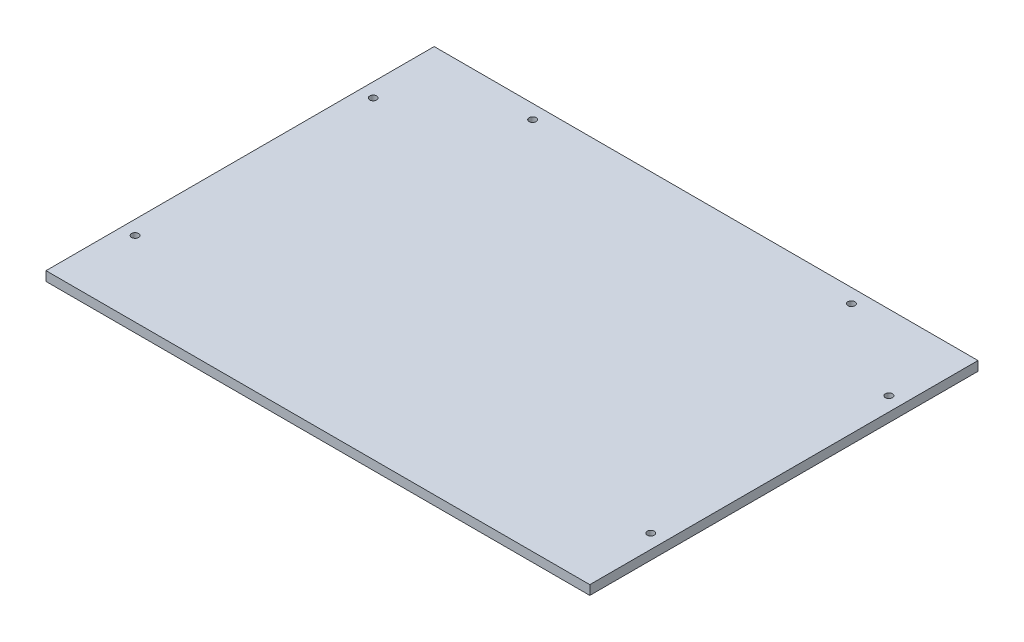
ISO-10303-21;
HEADER;
FILE_DESCRIPTION(('STEP AP214'),'2;1');
FILE_NAME('part.step','',(''),(''),'','','');
FILE_SCHEMA(('AUTOMOTIVE_DESIGN { 1 0 10303 214 1 1 1 1 }'));
ENDSEC;
DATA;
#1=APPLICATION_CONTEXT('core data for automotive mechanical design processes');
#2=APPLICATION_PROTOCOL_DEFINITION('international standard','automotive_design',2000,#1);
#3=PRODUCT_CONTEXT('',#1,'mechanical');
#4=PRODUCT('Part','Part','',(#3));
#5=PRODUCT_RELATED_PRODUCT_CATEGORY('part','',(#4));
#6=PRODUCT_DEFINITION_FORMATION('','',#4);
#7=PRODUCT_DEFINITION_CONTEXT('part definition',#1,'design');
#8=PRODUCT_DEFINITION('design','',#6,#7);
#9=PRODUCT_DEFINITION_SHAPE('','',#8);
#10=(LENGTH_UNIT() NAMED_UNIT(*) SI_UNIT(.MILLI.,.METRE.));
#11=(NAMED_UNIT(*) PLANE_ANGLE_UNIT() SI_UNIT($,.RADIAN.));
#12=(NAMED_UNIT(*) SI_UNIT($,.STERADIAN.) SOLID_ANGLE_UNIT());
#13=UNCERTAINTY_MEASURE_WITH_UNIT(LENGTH_MEASURE(1.E-05),#10,'distance_accuracy_value','');
#14=(GEOMETRIC_REPRESENTATION_CONTEXT(3) GLOBAL_UNCERTAINTY_ASSIGNED_CONTEXT((#13)) GLOBAL_UNIT_ASSIGNED_CONTEXT((#10,
#11,#12)) REPRESENTATION_CONTEXT('',''));
#15=CARTESIAN_POINT('',(0.,0.,0.));
#16=DIRECTION('',(0.,0.,1.));
#17=DIRECTION('',(1.,0.,0.));
#18=AXIS2_PLACEMENT_3D('',#15,#16,#17);
#19=CARTESIAN_POINT('',(0.,12.7,0.));
#20=DIRECTION('',(1.,0.,0.));
#21=DIRECTION('',(0.,0.,-1.));
#22=AXIS2_PLACEMENT_3D('',#19,#20,#21);
#23=PLANE('',#22);
#24=DIRECTION('',(0.,0.,1.));
#25=VECTOR('',#24,1.);
#26=CARTESIAN_POINT('',(0.,0.,0.));
#27=LINE('',#26,#25);
#28=CARTESIAN_POINT('',(0.,0.,-525.78));
#29=VERTEX_POINT('',#28);
#30=CARTESIAN_POINT('',(0.,0.,0.));
#31=VERTEX_POINT('',#30);
#32=EDGE_CURVE('E93',#29,#31,#27,.T.);
#33=ORIENTED_EDGE('',*,*,#32,.T.);
#34=DIRECTION('',(0.,-1.,0.));
#35=VECTOR('',#34,1.);
#36=CARTESIAN_POINT('',(0.,12.7,0.));
#37=LINE('',#36,#35);
#38=CARTESIAN_POINT('',(0.,12.7,0.));
#39=VERTEX_POINT('',#38);
#40=EDGE_CURVE('E11',#39,#31,#37,.T.);
#41=ORIENTED_EDGE('',*,*,#40,.F.);
#42=DIRECTION('',(0.,0.,1.));
#43=VECTOR('',#42,1.);
#44=CARTESIAN_POINT('',(0.,12.7,0.));
#45=LINE('',#44,#43);
#46=CARTESIAN_POINT('',(0.,12.7,-525.78));
#47=VERTEX_POINT('',#46);
#48=EDGE_CURVE('E81',#47,#39,#45,.T.);
#49=ORIENTED_EDGE('',*,*,#48,.F.);
#50=DIRECTION('',(0.,-1.,0.));
#51=VECTOR('',#50,1.);
#52=CARTESIAN_POINT('',(0.,12.7,-525.78));
#53=LINE('',#52,#51);
#54=EDGE_CURVE('E89',#47,#29,#53,.T.);
#55=ORIENTED_EDGE('',*,*,#54,.T.);
#56=EDGE_LOOP('',(#33,#41,#49,#55));
#57=FACE_BOUND('',#56,.T.);
#58=ADVANCED_FACE('F30',(#57),#23,.F.);
#59=CARTESIAN_POINT('',(0.,12.7,0.));
#60=DIRECTION('',(0.,0.,-1.));
#61=DIRECTION('',(-1.,0.,0.));
#62=AXIS2_PLACEMENT_3D('',#59,#60,#61);
#63=PLANE('',#62);
#64=DIRECTION('',(1.,0.,0.));
#65=VECTOR('',#64,1.);
#66=CARTESIAN_POINT('',(0.,0.,0.));
#67=LINE('',#66,#65);
#68=CARTESIAN_POINT('',(736.6,0.,0.));
#69=VERTEX_POINT('',#68);
#70=EDGE_CURVE('E85',#31,#69,#67,.T.);
#71=ORIENTED_EDGE('',*,*,#70,.T.);
#72=DIRECTION('',(0.,-1.,0.));
#73=VECTOR('',#72,1.);
#74=CARTESIAN_POINT('',(736.6,12.7,0.));
#75=LINE('',#74,#73);
#76=CARTESIAN_POINT('',(736.6,12.7,0.));
#77=VERTEX_POINT('',#76);
#78=EDGE_CURVE('E38',#77,#69,#75,.T.);
#79=ORIENTED_EDGE('',*,*,#78,.F.);
#80=DIRECTION('',(1.,0.,0.));
#81=VECTOR('',#80,1.);
#82=CARTESIAN_POINT('',(0.,12.7,0.));
#83=LINE('',#82,#81);
#84=EDGE_CURVE('E76',#39,#77,#83,.T.);
#85=ORIENTED_EDGE('',*,*,#84,.F.);
#86=ORIENTED_EDGE('',*,*,#40,.T.);
#87=EDGE_LOOP('',(#71,#79,#85,#86));
#88=FACE_BOUND('',#87,.T.);
#89=ADVANCED_FACE('F84',(#88),#63,.F.);
#90=CARTESIAN_POINT('',(736.6,12.7,0.));
#91=DIRECTION('',(-1.,0.,0.));
#92=DIRECTION('',(0.,0.,1.));
#93=AXIS2_PLACEMENT_3D('',#90,#91,#92);
#94=PLANE('',#93);
#95=DIRECTION('',(0.,0.,-1.));
#96=VECTOR('',#95,1.);
#97=CARTESIAN_POINT('',(736.6,0.,0.));
#98=LINE('',#97,#96);
#99=CARTESIAN_POINT('',(736.6,0.,-525.78));
#100=VERTEX_POINT('',#99);
#101=EDGE_CURVE('E63',#69,#100,#98,.T.);
#102=ORIENTED_EDGE('',*,*,#101,.T.);
#103=DIRECTION('',(0.,-1.,0.));
#104=VECTOR('',#103,1.);
#105=CARTESIAN_POINT('',(736.6,12.7,-525.78));
#106=LINE('',#105,#104);
#107=CARTESIAN_POINT('',(736.6,12.7,-525.78));
#108=VERTEX_POINT('',#107);
#109=EDGE_CURVE('E86',#108,#100,#106,.T.);
#110=ORIENTED_EDGE('',*,*,#109,.F.);
#111=DIRECTION('',(0.,0.,-1.));
#112=VECTOR('',#111,1.);
#113=CARTESIAN_POINT('',(736.6,12.7,0.));
#114=LINE('',#113,#112);
#115=EDGE_CURVE('E79',#77,#108,#114,.T.);
#116=ORIENTED_EDGE('',*,*,#115,.F.);
#117=ORIENTED_EDGE('',*,*,#78,.T.);
#118=EDGE_LOOP('',(#102,#110,#116,#117));
#119=FACE_BOUND('',#118,.T.);
#120=ADVANCED_FACE('F87',(#119),#94,.F.);
#121=CARTESIAN_POINT('',(0.,12.7,-525.78));
#122=DIRECTION('',(0.,0.,1.));
#123=DIRECTION('',(1.,0.,0.));
#124=AXIS2_PLACEMENT_3D('',#121,#122,#123);
#125=PLANE('',#124);
#126=DIRECTION('',(-1.,0.,0.));
#127=VECTOR('',#126,1.);
#128=CARTESIAN_POINT('',(0.,0.,-525.78));
#129=LINE('',#128,#127);
#130=EDGE_CURVE('E69',#100,#29,#129,.T.);
#131=ORIENTED_EDGE('',*,*,#130,.T.);
#132=ORIENTED_EDGE('',*,*,#54,.F.);
#133=DIRECTION('',(-1.,0.,0.));
#134=VECTOR('',#133,1.);
#135=CARTESIAN_POINT('',(0.,12.7,-525.78));
#136=LINE('',#135,#134);
#137=EDGE_CURVE('E46',#108,#47,#136,.T.);
#138=ORIENTED_EDGE('',*,*,#137,.F.);
#139=ORIENTED_EDGE('',*,*,#109,.T.);
#140=EDGE_LOOP('',(#131,#132,#138,#139));
#141=FACE_BOUND('',#140,.T.);
#142=ADVANCED_FACE('F101',(#141),#125,.F.);
#143=CARTESIAN_POINT('',(0.,12.7,-525.78));
#144=DIRECTION('',(0.,-1.,0.));
#145=DIRECTION('',(0.,0.,-1.));
#146=AXIS2_PLACEMENT_3D('',#143,#144,#145);
#147=PLANE('',#146);
#148=CARTESIAN_POINT('',(584.2,12.7,-506.73));
#149=DIRECTION('',(0.,1.,0.));
#150=DIRECTION('',(0.,0.,1.));
#151=AXIS2_PLACEMENT_3D('',#148,#149,#150);
#152=CIRCLE('',#151,4.76250000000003);
#153=CARTESIAN_POINT('',(584.2,12.7,-501.9675));
#154=VERTEX_POINT('',#153);
#155=EDGE_CURVE('E137',#154,#154,#152,.T.);
#156=ORIENTED_EDGE('',*,*,#155,.F.);
#157=EDGE_LOOP('',(#156));
#158=FACE_BOUND('',#157,.T.);
#159=CARTESIAN_POINT('',(152.4,12.7,-506.73));
#160=DIRECTION('',(0.,1.,0.));
#161=DIRECTION('',(0.,0.,1.));
#162=AXIS2_PLACEMENT_3D('',#159,#160,#161);
#163=CIRCLE('',#162,4.76250000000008);
#164=CARTESIAN_POINT('',(152.4,12.7,-501.9675));
#165=VERTEX_POINT('',#164);
#166=EDGE_CURVE('E131',#165,#165,#163,.T.);
#167=ORIENTED_EDGE('',*,*,#166,.F.);
#168=EDGE_LOOP('',(#167));
#169=FACE_BOUND('',#168,.T.);
#170=CARTESIAN_POINT('',(717.55,12.7,-424.18));
#171=DIRECTION('',(0.,1.,0.));
#172=DIRECTION('',(0.,0.,-1.));
#173=AXIS2_PLACEMENT_3D('',#170,#171,#172);
#174=CIRCLE('',#173,4.76250000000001);
#175=CARTESIAN_POINT('',(717.55,12.7,-419.4175));
#176=VERTEX_POINT('',#175);
#177=EDGE_CURVE('E125',#176,#176,#174,.T.);
#178=ORIENTED_EDGE('',*,*,#177,.F.);
#179=EDGE_LOOP('',(#178));
#180=FACE_BOUND('',#179,.T.);
#181=CARTESIAN_POINT('',(717.55,12.7,-101.6));
#182=DIRECTION('',(0.,1.,0.));
#183=DIRECTION('',(0.,0.,-1.));
#184=AXIS2_PLACEMENT_3D('',#181,#182,#183);
#185=CIRCLE('',#184,4.76250000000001);
#186=CARTESIAN_POINT('',(717.55,12.7,-96.8375));
#187=VERTEX_POINT('',#186);
#188=EDGE_CURVE('E119',#187,#187,#185,.T.);
#189=ORIENTED_EDGE('',*,*,#188,.F.);
#190=EDGE_LOOP('',(#189));
#191=FACE_BOUND('',#190,.T.);
#192=CARTESIAN_POINT('',(19.05,12.7,-101.6));
#193=DIRECTION('',(0.,1.,0.));
#194=DIRECTION('',(0.,0.,1.));
#195=AXIS2_PLACEMENT_3D('',#192,#193,#194);
#196=CIRCLE('',#195,4.7625);
#197=CARTESIAN_POINT('',(19.05,12.7,-96.8375));
#198=VERTEX_POINT('',#197);
#199=EDGE_CURVE('E113',#198,#198,#196,.T.);
#200=ORIENTED_EDGE('',*,*,#199,.F.);
#201=EDGE_LOOP('',(#200));
#202=FACE_BOUND('',#201,.T.);
#203=CARTESIAN_POINT('',(19.05,12.7,-424.18));
#204=DIRECTION('',(0.,1.,0.));
#205=DIRECTION('',(0.,0.,1.));
#206=AXIS2_PLACEMENT_3D('',#203,#204,#205);
#207=CIRCLE('',#206,4.7625);
#208=CARTESIAN_POINT('',(19.05,12.7,-419.4175));
#209=VERTEX_POINT('',#208);
#210=EDGE_CURVE('E107',#209,#209,#207,.T.);
#211=ORIENTED_EDGE('',*,*,#210,.F.);
#212=EDGE_LOOP('',(#211));
#213=FACE_BOUND('',#212,.T.);
#214=ORIENTED_EDGE('',*,*,#48,.T.);
#215=ORIENTED_EDGE('',*,*,#84,.T.);
#216=ORIENTED_EDGE('',*,*,#115,.T.);
#217=ORIENTED_EDGE('',*,*,#137,.T.);
#218=EDGE_LOOP('',(#214,#215,#216,#217));
#219=FACE_BOUND('',#218,.T.);
#220=ADVANCED_FACE('F77',(#158,#169,#180,#191,#202,#213,#219),#147,.F.);
#221=CARTESIAN_POINT('',(0.,0.,-525.78));
#222=DIRECTION('',(0.,-1.,0.));
#223=DIRECTION('',(0.,0.,-1.));
#224=AXIS2_PLACEMENT_3D('',#221,#222,#223);
#225=PLANE('',#224);
#226=CARTESIAN_POINT('',(584.2,0.,-506.73));
#227=DIRECTION('',(0.,1.,0.));
#228=DIRECTION('',(0.,0.,1.));
#229=AXIS2_PLACEMENT_3D('',#226,#227,#228);
#230=CIRCLE('',#229,4.76250000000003);
#231=CARTESIAN_POINT('',(584.2,0.,-501.9675));
#232=VERTEX_POINT('',#231);
#233=EDGE_CURVE('E134',#232,#232,#230,.T.);
#234=ORIENTED_EDGE('',*,*,#233,.T.);
#235=EDGE_LOOP('',(#234));
#236=FACE_BOUND('',#235,.T.);
#237=CARTESIAN_POINT('',(152.4,0.,-506.73));
#238=DIRECTION('',(0.,1.,0.));
#239=DIRECTION('',(0.,0.,1.));
#240=AXIS2_PLACEMENT_3D('',#237,#238,#239);
#241=CIRCLE('',#240,4.76250000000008);
#242=CARTESIAN_POINT('',(152.4,0.,-501.9675));
#243=VERTEX_POINT('',#242);
#244=EDGE_CURVE('E128',#243,#243,#241,.T.);
#245=ORIENTED_EDGE('',*,*,#244,.T.);
#246=EDGE_LOOP('',(#245));
#247=FACE_BOUND('',#246,.T.);
#248=CARTESIAN_POINT('',(717.55,0.,-424.18));
#249=DIRECTION('',(0.,1.,0.));
#250=DIRECTION('',(0.,0.,-1.));
#251=AXIS2_PLACEMENT_3D('',#248,#249,#250);
#252=CIRCLE('',#251,4.76250000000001);
#253=CARTESIAN_POINT('',(717.55,0.,-419.4175));
#254=VERTEX_POINT('',#253);
#255=EDGE_CURVE('E122',#254,#254,#252,.T.);
#256=ORIENTED_EDGE('',*,*,#255,.T.);
#257=EDGE_LOOP('',(#256));
#258=FACE_BOUND('',#257,.T.);
#259=CARTESIAN_POINT('',(717.55,0.,-101.6));
#260=DIRECTION('',(0.,1.,0.));
#261=DIRECTION('',(0.,0.,-1.));
#262=AXIS2_PLACEMENT_3D('',#259,#260,#261);
#263=CIRCLE('',#262,4.76250000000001);
#264=CARTESIAN_POINT('',(717.55,0.,-96.8375));
#265=VERTEX_POINT('',#264);
#266=EDGE_CURVE('E116',#265,#265,#263,.T.);
#267=ORIENTED_EDGE('',*,*,#266,.T.);
#268=EDGE_LOOP('',(#267));
#269=FACE_BOUND('',#268,.T.);
#270=CARTESIAN_POINT('',(19.05,0.,-101.6));
#271=DIRECTION('',(0.,1.,0.));
#272=DIRECTION('',(0.,0.,1.));
#273=AXIS2_PLACEMENT_3D('',#270,#271,#272);
#274=CIRCLE('',#273,4.7625);
#275=CARTESIAN_POINT('',(19.05,0.,-96.8375));
#276=VERTEX_POINT('',#275);
#277=EDGE_CURVE('E110',#276,#276,#274,.T.);
#278=ORIENTED_EDGE('',*,*,#277,.T.);
#279=EDGE_LOOP('',(#278));
#280=FACE_BOUND('',#279,.T.);
#281=CARTESIAN_POINT('',(19.05,0.,-424.18));
#282=DIRECTION('',(0.,1.,0.));
#283=DIRECTION('',(0.,0.,1.));
#284=AXIS2_PLACEMENT_3D('',#281,#282,#283);
#285=CIRCLE('',#284,4.7625);
#286=CARTESIAN_POINT('',(19.05,0.,-419.4175));
#287=VERTEX_POINT('',#286);
#288=EDGE_CURVE('E96',#287,#287,#285,.T.);
#289=ORIENTED_EDGE('',*,*,#288,.T.);
#290=EDGE_LOOP('',(#289));
#291=FACE_BOUND('',#290,.T.);
#292=ORIENTED_EDGE('',*,*,#32,.F.);
#293=ORIENTED_EDGE('',*,*,#130,.F.);
#294=ORIENTED_EDGE('',*,*,#101,.F.);
#295=ORIENTED_EDGE('',*,*,#70,.F.);
#296=EDGE_LOOP('',(#292,#293,#294,#295));
#297=FACE_BOUND('',#296,.T.);
#298=ADVANCED_FACE('F104',(#236,#247,#258,#269,#280,#291,#297),#225,.T.);
#299=CARTESIAN_POINT('',(19.05,0.,-424.18));
#300=DIRECTION('',(0.,1.,0.));
#301=DIRECTION('',(0.,0.,1.));
#302=AXIS2_PLACEMENT_3D('',#299,#300,#301);
#303=CYLINDRICAL_SURFACE('',#302,4.7625);
#304=CARTESIAN_POINT('',(19.05,0.,-419.4175));
#305=CARTESIAN_POINT('',(19.05,0.132291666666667,-419.4175));
#306=CARTESIAN_POINT('',(19.05,0.264583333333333,-419.4175));
#307=CARTESIAN_POINT('',(19.05,0.529166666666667,-419.4175));
#308=CARTESIAN_POINT('',(19.05,0.661458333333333,-419.4175));
#309=CARTESIAN_POINT('',(19.05,0.926041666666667,-419.4175));
#310=CARTESIAN_POINT('',(19.05,1.05833333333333,-419.4175));
#311=CARTESIAN_POINT('',(19.05,1.32291666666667,-419.4175));
#312=CARTESIAN_POINT('',(19.05,1.45520833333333,-419.4175));
#313=CARTESIAN_POINT('',(19.05,1.71979166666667,-419.4175));
#314=CARTESIAN_POINT('',(19.05,1.85208333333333,-419.4175));
#315=CARTESIAN_POINT('',(19.05,2.11666666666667,-419.4175));
#316=CARTESIAN_POINT('',(19.05,2.24895833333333,-419.4175));
#317=CARTESIAN_POINT('',(19.05,2.51354166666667,-419.4175));
#318=CARTESIAN_POINT('',(19.05,2.64583333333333,-419.4175));
#319=CARTESIAN_POINT('',(19.05,2.91041666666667,-419.4175));
#320=CARTESIAN_POINT('',(19.05,3.04270833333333,-419.4175));
#321=CARTESIAN_POINT('',(19.05,3.30729166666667,-419.4175));
#322=CARTESIAN_POINT('',(19.05,3.43958333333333,-419.4175));
#323=CARTESIAN_POINT('',(19.05,3.70416666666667,-419.4175));
#324=CARTESIAN_POINT('',(19.05,3.83645833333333,-419.4175));
#325=CARTESIAN_POINT('',(19.05,4.10104166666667,-419.4175));
#326=CARTESIAN_POINT('',(19.05,4.23333333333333,-419.4175));
#327=CARTESIAN_POINT('',(19.05,4.49791666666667,-419.4175));
#328=CARTESIAN_POINT('',(19.05,4.63020833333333,-419.4175));
#329=CARTESIAN_POINT('',(19.05,4.89479166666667,-419.4175));
#330=CARTESIAN_POINT('',(19.05,5.02708333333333,-419.4175));
#331=CARTESIAN_POINT('',(19.05,5.29166666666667,-419.4175));
#332=CARTESIAN_POINT('',(19.05,5.42395833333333,-419.4175));
#333=CARTESIAN_POINT('',(19.05,5.68854166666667,-419.4175));
#334=CARTESIAN_POINT('',(19.05,5.82083333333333,-419.4175));
#335=CARTESIAN_POINT('',(19.05,6.08541666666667,-419.4175));
#336=CARTESIAN_POINT('',(19.05,6.21770833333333,-419.4175));
#337=CARTESIAN_POINT('',(19.05,6.48229166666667,-419.4175));
#338=CARTESIAN_POINT('',(19.05,6.61458333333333,-419.4175));
#339=CARTESIAN_POINT('',(19.05,6.87916666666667,-419.4175));
#340=CARTESIAN_POINT('',(19.05,7.01145833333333,-419.4175));
#341=CARTESIAN_POINT('',(19.05,7.27604166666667,-419.4175));
#342=CARTESIAN_POINT('',(19.05,7.40833333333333,-419.4175));
#343=CARTESIAN_POINT('',(19.05,7.67291666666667,-419.4175));
#344=CARTESIAN_POINT('',(19.05,7.80520833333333,-419.4175));
#345=CARTESIAN_POINT('',(19.05,8.06979166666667,-419.4175));
#346=CARTESIAN_POINT('',(19.05,8.20208333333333,-419.4175));
#347=CARTESIAN_POINT('',(19.05,8.46666666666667,-419.4175));
#348=CARTESIAN_POINT('',(19.05,8.59895833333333,-419.4175));
#349=CARTESIAN_POINT('',(19.05,8.86354166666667,-419.4175));
#350=CARTESIAN_POINT('',(19.05,8.99583333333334,-419.4175));
#351=CARTESIAN_POINT('',(19.05,9.26041666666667,-419.4175));
#352=CARTESIAN_POINT('',(19.05,9.39270833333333,-419.4175));
#353=CARTESIAN_POINT('',(19.05,9.65729166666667,-419.4175));
#354=CARTESIAN_POINT('',(19.05,9.78958333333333,-419.4175));
#355=CARTESIAN_POINT('',(19.05,10.0541666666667,-419.4175));
#356=CARTESIAN_POINT('',(19.05,10.1864583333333,-419.4175));
#357=CARTESIAN_POINT('',(19.05,10.4510416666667,-419.4175));
#358=CARTESIAN_POINT('',(19.05,10.5833333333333,-419.4175));
#359=CARTESIAN_POINT('',(19.05,10.8479166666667,-419.4175));
#360=CARTESIAN_POINT('',(19.05,10.9802083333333,-419.4175));
#361=CARTESIAN_POINT('',(19.05,11.2447916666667,-419.4175));
#362=CARTESIAN_POINT('',(19.05,11.3770833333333,-419.4175));
#363=CARTESIAN_POINT('',(19.05,11.6416666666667,-419.4175));
#364=CARTESIAN_POINT('',(19.05,11.7739583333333,-419.4175));
#365=CARTESIAN_POINT('',(19.05,12.0385416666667,-419.4175));
#366=CARTESIAN_POINT('',(19.05,12.1708333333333,-419.4175));
#367=CARTESIAN_POINT('',(19.05,12.4354166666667,-419.4175));
#368=CARTESIAN_POINT('',(19.05,12.5677083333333,-419.4175));
#369=CARTESIAN_POINT('',(19.05,12.7,-419.4175));
#370=B_SPLINE_CURVE_WITH_KNOTS('',3,(#304,#305,#306,#307,#308,#309,#310,#311,#312,#313,#314,
#315,#316,#317,#318,#319,#320,#321,#322,#323,#324,#325,#326,#327,#328,#329,#330,#331,#332,#333,
#334,#335,#336,#337,#338,#339,#340,#341,#342,#343,#344,#345,#346,#347,#348,#349,#350,#351,#352,
#353,#354,#355,#356,#357,#358,#359,#360,#361,#362,#363,#364,#365,#366,#367,#368,#369),
.UNSPECIFIED.,.F.,.F.,(4,2,2,2,2,2,2,2,2,2,2,2,2,2,2,2,2,2,2,2,2,2,2,2,2,2,2,2,2,2,2,2,4),(0.,
0.396875,0.79375,1.190625,1.5875,1.984375,2.38125,2.778125,3.175,3.571875,3.96875,4.365625,
4.7625,5.159375,5.55625,5.953125,6.35,6.746875,7.14375,7.540625,7.9375,8.334375,8.73125,
9.128125,9.525,9.921875,10.31875,10.715625,11.1125,11.509375,11.90625,12.303125,12.7),.UNSPECIFIED.);
#371=EDGE_CURVE('BSEAM165',#287,#209,#370,.T.);
#372=ORIENTED_EDGE('',*,*,#288,.F.);
#373=ORIENTED_EDGE('',*,*,#210,.T.);
#374=ORIENTED_EDGE('',*,*,#371,.T.);
#375=ORIENTED_EDGE('',*,*,#371,.F.);
#376=EDGE_LOOP('',(#372,#374,#373,#375));
#377=FACE_BOUND('',#376,.T.);
#378=ADVANCED_FACE('F165',(#377),#303,.F.);
#379=CARTESIAN_POINT('',(19.05,0.,-101.6));
#380=DIRECTION('',(0.,1.,0.));
#381=DIRECTION('',(0.,0.,1.));
#382=AXIS2_PLACEMENT_3D('',#379,#380,#381);
#383=CYLINDRICAL_SURFACE('',#382,4.7625);
#384=CARTESIAN_POINT('',(19.05,0.,-96.8375));
#385=CARTESIAN_POINT('',(19.05,0.132291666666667,-96.8375));
#386=CARTESIAN_POINT('',(19.05,0.264583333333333,-96.8375));
#387=CARTESIAN_POINT('',(19.05,0.529166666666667,-96.8375));
#388=CARTESIAN_POINT('',(19.05,0.661458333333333,-96.8375));
#389=CARTESIAN_POINT('',(19.05,0.926041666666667,-96.8375));
#390=CARTESIAN_POINT('',(19.05,1.05833333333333,-96.8375));
#391=CARTESIAN_POINT('',(19.05,1.32291666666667,-96.8375));
#392=CARTESIAN_POINT('',(19.05,1.45520833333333,-96.8375));
#393=CARTESIAN_POINT('',(19.05,1.71979166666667,-96.8375));
#394=CARTESIAN_POINT('',(19.05,1.85208333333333,-96.8375));
#395=CARTESIAN_POINT('',(19.05,2.11666666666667,-96.8375));
#396=CARTESIAN_POINT('',(19.05,2.24895833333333,-96.8375));
#397=CARTESIAN_POINT('',(19.05,2.51354166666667,-96.8375));
#398=CARTESIAN_POINT('',(19.05,2.64583333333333,-96.8375));
#399=CARTESIAN_POINT('',(19.05,2.91041666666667,-96.8375));
#400=CARTESIAN_POINT('',(19.05,3.04270833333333,-96.8375));
#401=CARTESIAN_POINT('',(19.05,3.30729166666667,-96.8375));
#402=CARTESIAN_POINT('',(19.05,3.43958333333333,-96.8375));
#403=CARTESIAN_POINT('',(19.05,3.70416666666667,-96.8375));
#404=CARTESIAN_POINT('',(19.05,3.83645833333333,-96.8375));
#405=CARTESIAN_POINT('',(19.05,4.10104166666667,-96.8375));
#406=CARTESIAN_POINT('',(19.05,4.23333333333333,-96.8375));
#407=CARTESIAN_POINT('',(19.05,4.49791666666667,-96.8375));
#408=CARTESIAN_POINT('',(19.05,4.63020833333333,-96.8375));
#409=CARTESIAN_POINT('',(19.05,4.89479166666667,-96.8375));
#410=CARTESIAN_POINT('',(19.05,5.02708333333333,-96.8375));
#411=CARTESIAN_POINT('',(19.05,5.29166666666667,-96.8375));
#412=CARTESIAN_POINT('',(19.05,5.42395833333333,-96.8375));
#413=CARTESIAN_POINT('',(19.05,5.68854166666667,-96.8375));
#414=CARTESIAN_POINT('',(19.05,5.82083333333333,-96.8375));
#415=CARTESIAN_POINT('',(19.05,6.08541666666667,-96.8375));
#416=CARTESIAN_POINT('',(19.05,6.21770833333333,-96.8375));
#417=CARTESIAN_POINT('',(19.05,6.48229166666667,-96.8375));
#418=CARTESIAN_POINT('',(19.05,6.61458333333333,-96.8375));
#419=CARTESIAN_POINT('',(19.05,6.87916666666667,-96.8375));
#420=CARTESIAN_POINT('',(19.05,7.01145833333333,-96.8375));
#421=CARTESIAN_POINT('',(19.05,7.27604166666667,-96.8375));
#422=CARTESIAN_POINT('',(19.05,7.40833333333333,-96.8375));
#423=CARTESIAN_POINT('',(19.05,7.67291666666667,-96.8375));
#424=CARTESIAN_POINT('',(19.05,7.80520833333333,-96.8375));
#425=CARTESIAN_POINT('',(19.05,8.06979166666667,-96.8375));
#426=CARTESIAN_POINT('',(19.05,8.20208333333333,-96.8375));
#427=CARTESIAN_POINT('',(19.05,8.46666666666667,-96.8375));
#428=CARTESIAN_POINT('',(19.05,8.59895833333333,-96.8375));
#429=CARTESIAN_POINT('',(19.05,8.86354166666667,-96.8375));
#430=CARTESIAN_POINT('',(19.05,8.99583333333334,-96.8375));
#431=CARTESIAN_POINT('',(19.05,9.26041666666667,-96.8375));
#432=CARTESIAN_POINT('',(19.05,9.39270833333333,-96.8375));
#433=CARTESIAN_POINT('',(19.05,9.65729166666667,-96.8375));
#434=CARTESIAN_POINT('',(19.05,9.78958333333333,-96.8375));
#435=CARTESIAN_POINT('',(19.05,10.0541666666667,-96.8375));
#436=CARTESIAN_POINT('',(19.05,10.1864583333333,-96.8375));
#437=CARTESIAN_POINT('',(19.05,10.4510416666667,-96.8375));
#438=CARTESIAN_POINT('',(19.05,10.5833333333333,-96.8375));
#439=CARTESIAN_POINT('',(19.05,10.8479166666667,-96.8375));
#440=CARTESIAN_POINT('',(19.05,10.9802083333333,-96.8375));
#441=CARTESIAN_POINT('',(19.05,11.2447916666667,-96.8375));
#442=CARTESIAN_POINT('',(19.05,11.3770833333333,-96.8375));
#443=CARTESIAN_POINT('',(19.05,11.6416666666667,-96.8375));
#444=CARTESIAN_POINT('',(19.05,11.7739583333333,-96.8375));
#445=CARTESIAN_POINT('',(19.05,12.0385416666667,-96.8375));
#446=CARTESIAN_POINT('',(19.05,12.1708333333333,-96.8375));
#447=CARTESIAN_POINT('',(19.05,12.4354166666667,-96.8375));
#448=CARTESIAN_POINT('',(19.05,12.5677083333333,-96.8375));
#449=CARTESIAN_POINT('',(19.05,12.7,-96.8375));
#450=B_SPLINE_CURVE_WITH_KNOTS('',3,(#384,#385,#386,#387,#388,#389,#390,#391,#392,#393,#394,
#395,#396,#397,#398,#399,#400,#401,#402,#403,#404,#405,#406,#407,#408,#409,#410,#411,#412,#413,
#414,#415,#416,#417,#418,#419,#420,#421,#422,#423,#424,#425,#426,#427,#428,#429,#430,#431,#432,
#433,#434,#435,#436,#437,#438,#439,#440,#441,#442,#443,#444,#445,#446,#447,#448,#449),
.UNSPECIFIED.,.F.,.F.,(4,2,2,2,2,2,2,2,2,2,2,2,2,2,2,2,2,2,2,2,2,2,2,2,2,2,2,2,2,2,2,2,4),(0.,
0.396875,0.79375,1.190625,1.5875,1.984375,2.38125,2.778125,3.175,3.571875,3.96875,4.365625,
4.7625,5.159375,5.55625,5.953125,6.35,6.746875,7.14375,7.540625,7.9375,8.334375,8.73125,
9.128125,9.525,9.921875,10.31875,10.715625,11.1125,11.509375,11.90625,12.303125,12.7),.UNSPECIFIED.);
#451=EDGE_CURVE('BSEAM167',#276,#198,#450,.T.);
#452=ORIENTED_EDGE('',*,*,#277,.F.);
#453=ORIENTED_EDGE('',*,*,#199,.T.);
#454=ORIENTED_EDGE('',*,*,#451,.T.);
#455=ORIENTED_EDGE('',*,*,#451,.F.);
#456=EDGE_LOOP('',(#452,#454,#453,#455));
#457=FACE_BOUND('',#456,.T.);
#458=ADVANCED_FACE('F167',(#457),#383,.F.);
#459=CARTESIAN_POINT('',(717.55,0.,-101.6));
#460=DIRECTION('',(0.,1.,0.));
#461=DIRECTION('',(0.,0.,1.));
#462=AXIS2_PLACEMENT_3D('',#459,#460,#461);
#463=CYLINDRICAL_SURFACE('',#462,4.76250000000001);
#464=CARTESIAN_POINT('',(717.55,0.,-96.8375));
#465=CARTESIAN_POINT('',(717.55,0.132291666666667,-96.8375));
#466=CARTESIAN_POINT('',(717.55,0.264583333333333,-96.8375));
#467=CARTESIAN_POINT('',(717.55,0.529166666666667,-96.8375));
#468=CARTESIAN_POINT('',(717.55,0.661458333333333,-96.8375));
#469=CARTESIAN_POINT('',(717.55,0.926041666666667,-96.8375));
#470=CARTESIAN_POINT('',(717.55,1.05833333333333,-96.8375));
#471=CARTESIAN_POINT('',(717.55,1.32291666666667,-96.8375));
#472=CARTESIAN_POINT('',(717.55,1.45520833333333,-96.8375));
#473=CARTESIAN_POINT('',(717.55,1.71979166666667,-96.8375));
#474=CARTESIAN_POINT('',(717.55,1.85208333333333,-96.8375));
#475=CARTESIAN_POINT('',(717.55,2.11666666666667,-96.8375));
#476=CARTESIAN_POINT('',(717.55,2.24895833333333,-96.8375));
#477=CARTESIAN_POINT('',(717.55,2.51354166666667,-96.8375));
#478=CARTESIAN_POINT('',(717.55,2.64583333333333,-96.8375));
#479=CARTESIAN_POINT('',(717.55,2.91041666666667,-96.8375));
#480=CARTESIAN_POINT('',(717.55,3.04270833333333,-96.8375));
#481=CARTESIAN_POINT('',(717.55,3.30729166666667,-96.8375));
#482=CARTESIAN_POINT('',(717.55,3.43958333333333,-96.8375));
#483=CARTESIAN_POINT('',(717.55,3.70416666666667,-96.8375));
#484=CARTESIAN_POINT('',(717.55,3.83645833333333,-96.8375));
#485=CARTESIAN_POINT('',(717.55,4.10104166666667,-96.8375));
#486=CARTESIAN_POINT('',(717.55,4.23333333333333,-96.8375));
#487=CARTESIAN_POINT('',(717.55,4.49791666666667,-96.8375));
#488=CARTESIAN_POINT('',(717.55,4.63020833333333,-96.8375));
#489=CARTESIAN_POINT('',(717.55,4.89479166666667,-96.8375));
#490=CARTESIAN_POINT('',(717.55,5.02708333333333,-96.8375));
#491=CARTESIAN_POINT('',(717.55,5.29166666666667,-96.8375));
#492=CARTESIAN_POINT('',(717.55,5.42395833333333,-96.8375));
#493=CARTESIAN_POINT('',(717.55,5.68854166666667,-96.8375));
#494=CARTESIAN_POINT('',(717.55,5.82083333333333,-96.8375));
#495=CARTESIAN_POINT('',(717.55,6.08541666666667,-96.8375));
#496=CARTESIAN_POINT('',(717.55,6.21770833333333,-96.8375));
#497=CARTESIAN_POINT('',(717.55,6.48229166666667,-96.8375));
#498=CARTESIAN_POINT('',(717.55,6.61458333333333,-96.8375));
#499=CARTESIAN_POINT('',(717.55,6.87916666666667,-96.8375));
#500=CARTESIAN_POINT('',(717.55,7.01145833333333,-96.8375));
#501=CARTESIAN_POINT('',(717.55,7.27604166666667,-96.8375));
#502=CARTESIAN_POINT('',(717.55,7.40833333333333,-96.8375));
#503=CARTESIAN_POINT('',(717.55,7.67291666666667,-96.8375));
#504=CARTESIAN_POINT('',(717.55,7.80520833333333,-96.8375));
#505=CARTESIAN_POINT('',(717.55,8.06979166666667,-96.8375));
#506=CARTESIAN_POINT('',(717.55,8.20208333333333,-96.8375));
#507=CARTESIAN_POINT('',(717.55,8.46666666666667,-96.8375));
#508=CARTESIAN_POINT('',(717.55,8.59895833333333,-96.8375));
#509=CARTESIAN_POINT('',(717.55,8.86354166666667,-96.8375));
#510=CARTESIAN_POINT('',(717.55,8.99583333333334,-96.8375));
#511=CARTESIAN_POINT('',(717.55,9.26041666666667,-96.8375));
#512=CARTESIAN_POINT('',(717.55,9.39270833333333,-96.8375));
#513=CARTESIAN_POINT('',(717.55,9.65729166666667,-96.8375));
#514=CARTESIAN_POINT('',(717.55,9.78958333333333,-96.8375));
#515=CARTESIAN_POINT('',(717.55,10.0541666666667,-96.8375));
#516=CARTESIAN_POINT('',(717.55,10.1864583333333,-96.8375));
#517=CARTESIAN_POINT('',(717.55,10.4510416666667,-96.8375));
#518=CARTESIAN_POINT('',(717.55,10.5833333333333,-96.8375));
#519=CARTESIAN_POINT('',(717.55,10.8479166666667,-96.8375));
#520=CARTESIAN_POINT('',(717.55,10.9802083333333,-96.8375));
#521=CARTESIAN_POINT('',(717.55,11.2447916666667,-96.8375));
#522=CARTESIAN_POINT('',(717.55,11.3770833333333,-96.8375));
#523=CARTESIAN_POINT('',(717.55,11.6416666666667,-96.8375));
#524=CARTESIAN_POINT('',(717.55,11.7739583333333,-96.8375));
#525=CARTESIAN_POINT('',(717.55,12.0385416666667,-96.8375));
#526=CARTESIAN_POINT('',(717.55,12.1708333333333,-96.8375));
#527=CARTESIAN_POINT('',(717.55,12.4354166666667,-96.8375));
#528=CARTESIAN_POINT('',(717.55,12.5677083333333,-96.8375));
#529=CARTESIAN_POINT('',(717.55,12.7,-96.8375));
#530=B_SPLINE_CURVE_WITH_KNOTS('',3,(#464,#465,#466,#467,#468,#469,#470,#471,#472,#473,#474,
#475,#476,#477,#478,#479,#480,#481,#482,#483,#484,#485,#486,#487,#488,#489,#490,#491,#492,#493,
#494,#495,#496,#497,#498,#499,#500,#501,#502,#503,#504,#505,#506,#507,#508,#509,#510,#511,#512,
#513,#514,#515,#516,#517,#518,#519,#520,#521,#522,#523,#524,#525,#526,#527,#528,#529),
.UNSPECIFIED.,.F.,.F.,(4,2,2,2,2,2,2,2,2,2,2,2,2,2,2,2,2,2,2,2,2,2,2,2,2,2,2,2,2,2,2,2,4),(0.,
0.396875,0.79375,1.190625,1.5875,1.984375,2.38125,2.778125,3.175,3.571875,3.96875,4.365625,
4.7625,5.159375,5.55625,5.953125,6.35,6.746875,7.14375,7.540625,7.9375,8.334375,8.73125,
9.128125,9.525,9.921875,10.31875,10.715625,11.1125,11.509375,11.90625,12.303125,12.7),.UNSPECIFIED.);
#531=EDGE_CURVE('BSEAM174',#265,#187,#530,.T.);
#532=ORIENTED_EDGE('',*,*,#266,.F.);
#533=ORIENTED_EDGE('',*,*,#188,.T.);
#534=ORIENTED_EDGE('',*,*,#531,.T.);
#535=ORIENTED_EDGE('',*,*,#531,.F.);
#536=EDGE_LOOP('',(#532,#534,#533,#535));
#537=FACE_BOUND('',#536,.T.);
#538=ADVANCED_FACE('F174',(#537),#463,.F.);
#539=CARTESIAN_POINT('',(717.55,0.,-424.18));
#540=DIRECTION('',(0.,1.,0.));
#541=DIRECTION('',(0.,0.,1.));
#542=AXIS2_PLACEMENT_3D('',#539,#540,#541);
#543=CYLINDRICAL_SURFACE('',#542,4.76250000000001);
#544=CARTESIAN_POINT('',(717.55,0.,-419.4175));
#545=CARTESIAN_POINT('',(717.55,0.132291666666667,-419.4175));
#546=CARTESIAN_POINT('',(717.55,0.264583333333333,-419.4175));
#547=CARTESIAN_POINT('',(717.55,0.529166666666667,-419.4175));
#548=CARTESIAN_POINT('',(717.55,0.661458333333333,-419.4175));
#549=CARTESIAN_POINT('',(717.55,0.926041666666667,-419.4175));
#550=CARTESIAN_POINT('',(717.55,1.05833333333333,-419.4175));
#551=CARTESIAN_POINT('',(717.55,1.32291666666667,-419.4175));
#552=CARTESIAN_POINT('',(717.55,1.45520833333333,-419.4175));
#553=CARTESIAN_POINT('',(717.55,1.71979166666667,-419.4175));
#554=CARTESIAN_POINT('',(717.55,1.85208333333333,-419.4175));
#555=CARTESIAN_POINT('',(717.55,2.11666666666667,-419.4175));
#556=CARTESIAN_POINT('',(717.55,2.24895833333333,-419.4175));
#557=CARTESIAN_POINT('',(717.55,2.51354166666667,-419.4175));
#558=CARTESIAN_POINT('',(717.55,2.64583333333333,-419.4175));
#559=CARTESIAN_POINT('',(717.55,2.91041666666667,-419.4175));
#560=CARTESIAN_POINT('',(717.55,3.04270833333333,-419.4175));
#561=CARTESIAN_POINT('',(717.55,3.30729166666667,-419.4175));
#562=CARTESIAN_POINT('',(717.55,3.43958333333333,-419.4175));
#563=CARTESIAN_POINT('',(717.55,3.70416666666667,-419.4175));
#564=CARTESIAN_POINT('',(717.55,3.83645833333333,-419.4175));
#565=CARTESIAN_POINT('',(717.55,4.10104166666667,-419.4175));
#566=CARTESIAN_POINT('',(717.55,4.23333333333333,-419.4175));
#567=CARTESIAN_POINT('',(717.55,4.49791666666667,-419.4175));
#568=CARTESIAN_POINT('',(717.55,4.63020833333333,-419.4175));
#569=CARTESIAN_POINT('',(717.55,4.89479166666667,-419.4175));
#570=CARTESIAN_POINT('',(717.55,5.02708333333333,-419.4175));
#571=CARTESIAN_POINT('',(717.55,5.29166666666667,-419.4175));
#572=CARTESIAN_POINT('',(717.55,5.42395833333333,-419.4175));
#573=CARTESIAN_POINT('',(717.55,5.68854166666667,-419.4175));
#574=CARTESIAN_POINT('',(717.55,5.82083333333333,-419.4175));
#575=CARTESIAN_POINT('',(717.55,6.08541666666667,-419.4175));
#576=CARTESIAN_POINT('',(717.55,6.21770833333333,-419.4175));
#577=CARTESIAN_POINT('',(717.55,6.48229166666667,-419.4175));
#578=CARTESIAN_POINT('',(717.55,6.61458333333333,-419.4175));
#579=CARTESIAN_POINT('',(717.55,6.87916666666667,-419.4175));
#580=CARTESIAN_POINT('',(717.55,7.01145833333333,-419.4175));
#581=CARTESIAN_POINT('',(717.55,7.27604166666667,-419.4175));
#582=CARTESIAN_POINT('',(717.55,7.40833333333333,-419.4175));
#583=CARTESIAN_POINT('',(717.55,7.67291666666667,-419.4175));
#584=CARTESIAN_POINT('',(717.55,7.80520833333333,-419.4175));
#585=CARTESIAN_POINT('',(717.55,8.06979166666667,-419.4175));
#586=CARTESIAN_POINT('',(717.55,8.20208333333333,-419.4175));
#587=CARTESIAN_POINT('',(717.55,8.46666666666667,-419.4175));
#588=CARTESIAN_POINT('',(717.55,8.59895833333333,-419.4175));
#589=CARTESIAN_POINT('',(717.55,8.86354166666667,-419.4175));
#590=CARTESIAN_POINT('',(717.55,8.99583333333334,-419.4175));
#591=CARTESIAN_POINT('',(717.55,9.26041666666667,-419.4175));
#592=CARTESIAN_POINT('',(717.55,9.39270833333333,-419.4175));
#593=CARTESIAN_POINT('',(717.55,9.65729166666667,-419.4175));
#594=CARTESIAN_POINT('',(717.55,9.78958333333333,-419.4175));
#595=CARTESIAN_POINT('',(717.55,10.0541666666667,-419.4175));
#596=CARTESIAN_POINT('',(717.55,10.1864583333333,-419.4175));
#597=CARTESIAN_POINT('',(717.55,10.4510416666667,-419.4175));
#598=CARTESIAN_POINT('',(717.55,10.5833333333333,-419.4175));
#599=CARTESIAN_POINT('',(717.55,10.8479166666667,-419.4175));
#600=CARTESIAN_POINT('',(717.55,10.9802083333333,-419.4175));
#601=CARTESIAN_POINT('',(717.55,11.2447916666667,-419.4175));
#602=CARTESIAN_POINT('',(717.55,11.3770833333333,-419.4175));
#603=CARTESIAN_POINT('',(717.55,11.6416666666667,-419.4175));
#604=CARTESIAN_POINT('',(717.55,11.7739583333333,-419.4175));
#605=CARTESIAN_POINT('',(717.55,12.0385416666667,-419.4175));
#606=CARTESIAN_POINT('',(717.55,12.1708333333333,-419.4175));
#607=CARTESIAN_POINT('',(717.55,12.4354166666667,-419.4175));
#608=CARTESIAN_POINT('',(717.55,12.5677083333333,-419.4175));
#609=CARTESIAN_POINT('',(717.55,12.7,-419.4175));
#610=B_SPLINE_CURVE_WITH_KNOTS('',3,(#544,#545,#546,#547,#548,#549,#550,#551,#552,#553,#554,
#555,#556,#557,#558,#559,#560,#561,#562,#563,#564,#565,#566,#567,#568,#569,#570,#571,#572,#573,
#574,#575,#576,#577,#578,#579,#580,#581,#582,#583,#584,#585,#586,#587,#588,#589,#590,#591,#592,
#593,#594,#595,#596,#597,#598,#599,#600,#601,#602,#603,#604,#605,#606,#607,#608,#609),
.UNSPECIFIED.,.F.,.F.,(4,2,2,2,2,2,2,2,2,2,2,2,2,2,2,2,2,2,2,2,2,2,2,2,2,2,2,2,2,2,2,2,4),(0.,
0.396875,0.79375,1.190625,1.5875,1.984375,2.38125,2.778125,3.175,3.571875,3.96875,4.365625,
4.7625,5.159375,5.55625,5.953125,6.35,6.746875,7.14375,7.540625,7.9375,8.334375,8.73125,
9.128125,9.525,9.921875,10.31875,10.715625,11.1125,11.509375,11.90625,12.303125,12.7),.UNSPECIFIED.);
#611=EDGE_CURVE('BSEAM212',#254,#176,#610,.T.);
#612=ORIENTED_EDGE('',*,*,#255,.F.);
#613=ORIENTED_EDGE('',*,*,#177,.T.);
#614=ORIENTED_EDGE('',*,*,#611,.T.);
#615=ORIENTED_EDGE('',*,*,#611,.F.);
#616=EDGE_LOOP('',(#612,#614,#613,#615));
#617=FACE_BOUND('',#616,.T.);
#618=ADVANCED_FACE('F212',(#617),#543,.F.);
#619=CARTESIAN_POINT('',(152.4,0.,-506.73));
#620=DIRECTION('',(0.,1.,0.));
#621=DIRECTION('',(0.,0.,1.));
#622=AXIS2_PLACEMENT_3D('',#619,#620,#621);
#623=CYLINDRICAL_SURFACE('',#622,4.76250000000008);
#624=CARTESIAN_POINT('',(152.4,0.,-501.9675));
#625=CARTESIAN_POINT('',(152.4,0.132291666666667,-501.9675));
#626=CARTESIAN_POINT('',(152.4,0.264583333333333,-501.9675));
#627=CARTESIAN_POINT('',(152.4,0.529166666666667,-501.9675));
#628=CARTESIAN_POINT('',(152.4,0.661458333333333,-501.9675));
#629=CARTESIAN_POINT('',(152.4,0.926041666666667,-501.9675));
#630=CARTESIAN_POINT('',(152.4,1.05833333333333,-501.9675));
#631=CARTESIAN_POINT('',(152.4,1.32291666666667,-501.9675));
#632=CARTESIAN_POINT('',(152.4,1.45520833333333,-501.9675));
#633=CARTESIAN_POINT('',(152.4,1.71979166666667,-501.9675));
#634=CARTESIAN_POINT('',(152.4,1.85208333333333,-501.9675));
#635=CARTESIAN_POINT('',(152.4,2.11666666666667,-501.9675));
#636=CARTESIAN_POINT('',(152.4,2.24895833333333,-501.9675));
#637=CARTESIAN_POINT('',(152.4,2.51354166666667,-501.9675));
#638=CARTESIAN_POINT('',(152.4,2.64583333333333,-501.9675));
#639=CARTESIAN_POINT('',(152.4,2.91041666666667,-501.9675));
#640=CARTESIAN_POINT('',(152.4,3.04270833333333,-501.9675));
#641=CARTESIAN_POINT('',(152.4,3.30729166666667,-501.9675));
#642=CARTESIAN_POINT('',(152.4,3.43958333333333,-501.9675));
#643=CARTESIAN_POINT('',(152.4,3.70416666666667,-501.9675));
#644=CARTESIAN_POINT('',(152.4,3.83645833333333,-501.9675));
#645=CARTESIAN_POINT('',(152.4,4.10104166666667,-501.9675));
#646=CARTESIAN_POINT('',(152.4,4.23333333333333,-501.9675));
#647=CARTESIAN_POINT('',(152.4,4.49791666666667,-501.9675));
#648=CARTESIAN_POINT('',(152.4,4.63020833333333,-501.9675));
#649=CARTESIAN_POINT('',(152.4,4.89479166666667,-501.9675));
#650=CARTESIAN_POINT('',(152.4,5.02708333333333,-501.9675));
#651=CARTESIAN_POINT('',(152.4,5.29166666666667,-501.9675));
#652=CARTESIAN_POINT('',(152.4,5.42395833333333,-501.9675));
#653=CARTESIAN_POINT('',(152.4,5.68854166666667,-501.9675));
#654=CARTESIAN_POINT('',(152.4,5.82083333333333,-501.9675));
#655=CARTESIAN_POINT('',(152.4,6.08541666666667,-501.9675));
#656=CARTESIAN_POINT('',(152.4,6.21770833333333,-501.9675));
#657=CARTESIAN_POINT('',(152.4,6.48229166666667,-501.9675));
#658=CARTESIAN_POINT('',(152.4,6.61458333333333,-501.9675));
#659=CARTESIAN_POINT('',(152.4,6.87916666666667,-501.9675));
#660=CARTESIAN_POINT('',(152.4,7.01145833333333,-501.9675));
#661=CARTESIAN_POINT('',(152.4,7.27604166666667,-501.9675));
#662=CARTESIAN_POINT('',(152.4,7.40833333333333,-501.9675));
#663=CARTESIAN_POINT('',(152.4,7.67291666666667,-501.9675));
#664=CARTESIAN_POINT('',(152.4,7.80520833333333,-501.9675));
#665=CARTESIAN_POINT('',(152.4,8.06979166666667,-501.9675));
#666=CARTESIAN_POINT('',(152.4,8.20208333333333,-501.9675));
#667=CARTESIAN_POINT('',(152.4,8.46666666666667,-501.9675));
#668=CARTESIAN_POINT('',(152.4,8.59895833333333,-501.9675));
#669=CARTESIAN_POINT('',(152.4,8.86354166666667,-501.9675));
#670=CARTESIAN_POINT('',(152.4,8.99583333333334,-501.9675));
#671=CARTESIAN_POINT('',(152.4,9.26041666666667,-501.9675));
#672=CARTESIAN_POINT('',(152.4,9.39270833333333,-501.9675));
#673=CARTESIAN_POINT('',(152.4,9.65729166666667,-501.9675));
#674=CARTESIAN_POINT('',(152.4,9.78958333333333,-501.9675));
#675=CARTESIAN_POINT('',(152.4,10.0541666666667,-501.9675));
#676=CARTESIAN_POINT('',(152.4,10.1864583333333,-501.9675));
#677=CARTESIAN_POINT('',(152.4,10.4510416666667,-501.9675));
#678=CARTESIAN_POINT('',(152.4,10.5833333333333,-501.9675));
#679=CARTESIAN_POINT('',(152.4,10.8479166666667,-501.9675));
#680=CARTESIAN_POINT('',(152.4,10.9802083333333,-501.9675));
#681=CARTESIAN_POINT('',(152.4,11.2447916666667,-501.9675));
#682=CARTESIAN_POINT('',(152.4,11.3770833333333,-501.9675));
#683=CARTESIAN_POINT('',(152.4,11.6416666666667,-501.9675));
#684=CARTESIAN_POINT('',(152.4,11.7739583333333,-501.9675));
#685=CARTESIAN_POINT('',(152.4,12.0385416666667,-501.9675));
#686=CARTESIAN_POINT('',(152.4,12.1708333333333,-501.9675));
#687=CARTESIAN_POINT('',(152.4,12.4354166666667,-501.9675));
#688=CARTESIAN_POINT('',(152.4,12.5677083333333,-501.9675));
#689=CARTESIAN_POINT('',(152.4,12.7,-501.9675));
#690=B_SPLINE_CURVE_WITH_KNOTS('',3,(#624,#625,#626,#627,#628,#629,#630,#631,#632,#633,#634,
#635,#636,#637,#638,#639,#640,#641,#642,#643,#644,#645,#646,#647,#648,#649,#650,#651,#652,#653,
#654,#655,#656,#657,#658,#659,#660,#661,#662,#663,#664,#665,#666,#667,#668,#669,#670,#671,#672,
#673,#674,#675,#676,#677,#678,#679,#680,#681,#682,#683,#684,#685,#686,#687,#688,#689),
.UNSPECIFIED.,.F.,.F.,(4,2,2,2,2,2,2,2,2,2,2,2,2,2,2,2,2,2,2,2,2,2,2,2,2,2,2,2,2,2,2,2,4),(0.,
0.396875,0.79375,1.190625,1.5875,1.984375,2.38125,2.778125,3.175,3.571875,3.96875,4.365625,
4.7625,5.159375,5.55625,5.953125,6.35,6.746875,7.14375,7.540625,7.9375,8.334375,8.73125,
9.128125,9.525,9.921875,10.31875,10.715625,11.1125,11.509375,11.90625,12.303125,12.7),.UNSPECIFIED.);
#691=EDGE_CURVE('BSEAM148',#243,#165,#690,.T.);
#692=ORIENTED_EDGE('',*,*,#244,.F.);
#693=ORIENTED_EDGE('',*,*,#166,.T.);
#694=ORIENTED_EDGE('',*,*,#691,.T.);
#695=ORIENTED_EDGE('',*,*,#691,.F.);
#696=EDGE_LOOP('',(#692,#694,#693,#695));
#697=FACE_BOUND('',#696,.T.);
#698=ADVANCED_FACE('F148',(#697),#623,.F.);
#699=CARTESIAN_POINT('',(584.2,0.,-506.73));
#700=DIRECTION('',(0.,1.,0.));
#701=DIRECTION('',(0.,0.,1.));
#702=AXIS2_PLACEMENT_3D('',#699,#700,#701);
#703=CYLINDRICAL_SURFACE('',#702,4.76250000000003);
#704=CARTESIAN_POINT('',(584.2,0.,-501.9675));
#705=CARTESIAN_POINT('',(584.2,0.132291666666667,-501.9675));
#706=CARTESIAN_POINT('',(584.2,0.264583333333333,-501.9675));
#707=CARTESIAN_POINT('',(584.2,0.529166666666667,-501.9675));
#708=CARTESIAN_POINT('',(584.2,0.661458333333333,-501.9675));
#709=CARTESIAN_POINT('',(584.2,0.926041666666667,-501.9675));
#710=CARTESIAN_POINT('',(584.2,1.05833333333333,-501.9675));
#711=CARTESIAN_POINT('',(584.2,1.32291666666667,-501.9675));
#712=CARTESIAN_POINT('',(584.2,1.45520833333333,-501.9675));
#713=CARTESIAN_POINT('',(584.2,1.71979166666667,-501.9675));
#714=CARTESIAN_POINT('',(584.2,1.85208333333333,-501.9675));
#715=CARTESIAN_POINT('',(584.2,2.11666666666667,-501.9675));
#716=CARTESIAN_POINT('',(584.2,2.24895833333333,-501.9675));
#717=CARTESIAN_POINT('',(584.2,2.51354166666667,-501.9675));
#718=CARTESIAN_POINT('',(584.2,2.64583333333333,-501.9675));
#719=CARTESIAN_POINT('',(584.2,2.91041666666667,-501.9675));
#720=CARTESIAN_POINT('',(584.2,3.04270833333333,-501.9675));
#721=CARTESIAN_POINT('',(584.2,3.30729166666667,-501.9675));
#722=CARTESIAN_POINT('',(584.2,3.43958333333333,-501.9675));
#723=CARTESIAN_POINT('',(584.2,3.70416666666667,-501.9675));
#724=CARTESIAN_POINT('',(584.2,3.83645833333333,-501.9675));
#725=CARTESIAN_POINT('',(584.2,4.10104166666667,-501.9675));
#726=CARTESIAN_POINT('',(584.2,4.23333333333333,-501.9675));
#727=CARTESIAN_POINT('',(584.2,4.49791666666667,-501.9675));
#728=CARTESIAN_POINT('',(584.2,4.63020833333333,-501.9675));
#729=CARTESIAN_POINT('',(584.2,4.89479166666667,-501.9675));
#730=CARTESIAN_POINT('',(584.2,5.02708333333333,-501.9675));
#731=CARTESIAN_POINT('',(584.2,5.29166666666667,-501.9675));
#732=CARTESIAN_POINT('',(584.2,5.42395833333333,-501.9675));
#733=CARTESIAN_POINT('',(584.2,5.68854166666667,-501.9675));
#734=CARTESIAN_POINT('',(584.2,5.82083333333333,-501.9675));
#735=CARTESIAN_POINT('',(584.2,6.08541666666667,-501.9675));
#736=CARTESIAN_POINT('',(584.2,6.21770833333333,-501.9675));
#737=CARTESIAN_POINT('',(584.2,6.48229166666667,-501.9675));
#738=CARTESIAN_POINT('',(584.2,6.61458333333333,-501.9675));
#739=CARTESIAN_POINT('',(584.2,6.87916666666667,-501.9675));
#740=CARTESIAN_POINT('',(584.2,7.01145833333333,-501.9675));
#741=CARTESIAN_POINT('',(584.2,7.27604166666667,-501.9675));
#742=CARTESIAN_POINT('',(584.2,7.40833333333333,-501.9675));
#743=CARTESIAN_POINT('',(584.2,7.67291666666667,-501.9675));
#744=CARTESIAN_POINT('',(584.2,7.80520833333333,-501.9675));
#745=CARTESIAN_POINT('',(584.2,8.06979166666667,-501.9675));
#746=CARTESIAN_POINT('',(584.2,8.20208333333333,-501.9675));
#747=CARTESIAN_POINT('',(584.2,8.46666666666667,-501.9675));
#748=CARTESIAN_POINT('',(584.2,8.59895833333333,-501.9675));
#749=CARTESIAN_POINT('',(584.2,8.86354166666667,-501.9675));
#750=CARTESIAN_POINT('',(584.2,8.99583333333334,-501.9675));
#751=CARTESIAN_POINT('',(584.2,9.26041666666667,-501.9675));
#752=CARTESIAN_POINT('',(584.2,9.39270833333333,-501.9675));
#753=CARTESIAN_POINT('',(584.2,9.65729166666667,-501.9675));
#754=CARTESIAN_POINT('',(584.2,9.78958333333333,-501.9675));
#755=CARTESIAN_POINT('',(584.2,10.0541666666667,-501.9675));
#756=CARTESIAN_POINT('',(584.2,10.1864583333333,-501.9675));
#757=CARTESIAN_POINT('',(584.2,10.4510416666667,-501.9675));
#758=CARTESIAN_POINT('',(584.2,10.5833333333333,-501.9675));
#759=CARTESIAN_POINT('',(584.2,10.8479166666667,-501.9675));
#760=CARTESIAN_POINT('',(584.2,10.9802083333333,-501.9675));
#761=CARTESIAN_POINT('',(584.2,11.2447916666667,-501.9675));
#762=CARTESIAN_POINT('',(584.2,11.3770833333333,-501.9675));
#763=CARTESIAN_POINT('',(584.2,11.6416666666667,-501.9675));
#764=CARTESIAN_POINT('',(584.2,11.7739583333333,-501.9675));
#765=CARTESIAN_POINT('',(584.2,12.0385416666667,-501.9675));
#766=CARTESIAN_POINT('',(584.2,12.1708333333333,-501.9675));
#767=CARTESIAN_POINT('',(584.2,12.4354166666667,-501.9675));
#768=CARTESIAN_POINT('',(584.2,12.5677083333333,-501.9675));
#769=CARTESIAN_POINT('',(584.2,12.7,-501.9675));
#770=B_SPLINE_CURVE_WITH_KNOTS('',3,(#704,#705,#706,#707,#708,#709,#710,#711,#712,#713,#714,
#715,#716,#717,#718,#719,#720,#721,#722,#723,#724,#725,#726,#727,#728,#729,#730,#731,#732,#733,
#734,#735,#736,#737,#738,#739,#740,#741,#742,#743,#744,#745,#746,#747,#748,#749,#750,#751,#752,
#753,#754,#755,#756,#757,#758,#759,#760,#761,#762,#763,#764,#765,#766,#767,#768,#769),
.UNSPECIFIED.,.F.,.F.,(4,2,2,2,2,2,2,2,2,2,2,2,2,2,2,2,2,2,2,2,2,2,2,2,2,2,2,2,2,2,2,2,4),(0.,
0.396875,0.79375,1.190625,1.5875,1.984375,2.38125,2.778125,3.175,3.571875,3.96875,4.365625,
4.7625,5.159375,5.55625,5.953125,6.35,6.746875,7.14375,7.540625,7.9375,8.334375,8.73125,
9.128125,9.525,9.921875,10.31875,10.715625,11.1125,11.509375,11.90625,12.303125,12.7),.UNSPECIFIED.);
#771=EDGE_CURVE('BSEAM145',#232,#154,#770,.T.);
#772=ORIENTED_EDGE('',*,*,#233,.F.);
#773=ORIENTED_EDGE('',*,*,#155,.T.);
#774=ORIENTED_EDGE('',*,*,#771,.T.);
#775=ORIENTED_EDGE('',*,*,#771,.F.);
#776=EDGE_LOOP('',(#772,#774,#773,#775));
#777=FACE_BOUND('',#776,.T.);
#778=ADVANCED_FACE('F145',(#777),#703,.F.);
#779=CLOSED_SHELL('',(#58,#89,#120,#142,#220,#298,#378,#458,#538,#618,#698,#778));
#780=MANIFOLD_SOLID_BREP('B2',#779);
#781=ADVANCED_BREP_SHAPE_REPRESENTATION('',(#18,#780),#14);
#782=SHAPE_DEFINITION_REPRESENTATION(#9,#781);
ENDSEC;
END-ISO-10303-21;
